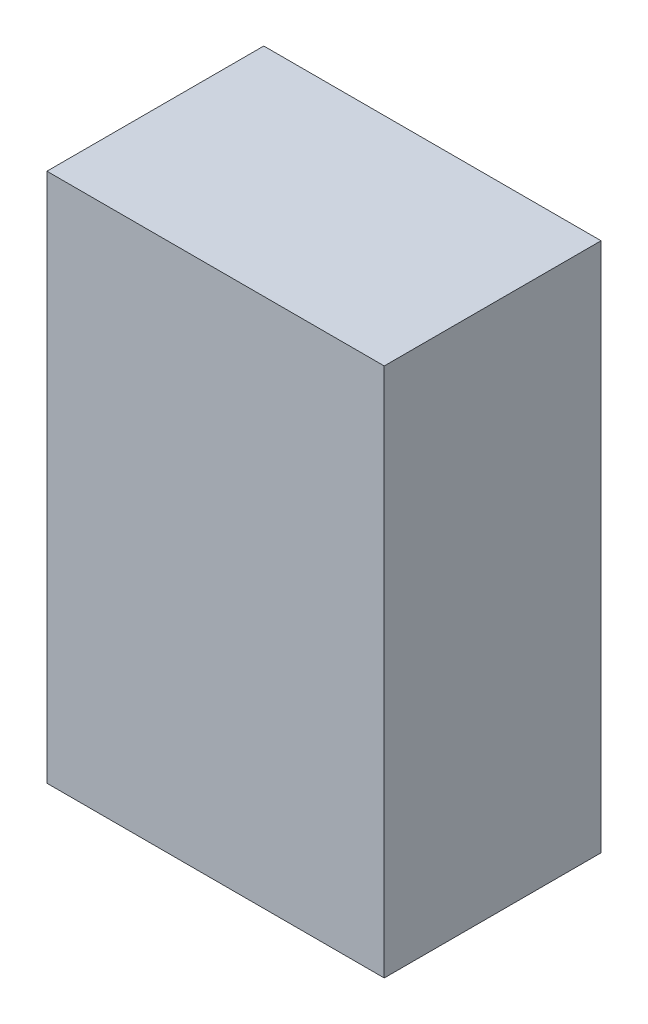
ISO-10303-21;
HEADER;
FILE_DESCRIPTION(('STEP AP214'),'2;1');
FILE_NAME('part.step','',(''),(''),'','','');
FILE_SCHEMA(('AUTOMOTIVE_DESIGN { 1 0 10303 214 1 1 1 1 }'));
ENDSEC;
DATA;
#1=APPLICATION_CONTEXT('core data for automotive mechanical design processes');
#2=APPLICATION_PROTOCOL_DEFINITION('international standard','automotive_design',2000,#1);
#3=PRODUCT_CONTEXT('',#1,'mechanical');
#4=PRODUCT('Part','Part','',(#3));
#5=PRODUCT_RELATED_PRODUCT_CATEGORY('part','',(#4));
#6=PRODUCT_DEFINITION_FORMATION('','',#4);
#7=PRODUCT_DEFINITION_CONTEXT('part definition',#1,'design');
#8=PRODUCT_DEFINITION('design','',#6,#7);
#9=PRODUCT_DEFINITION_SHAPE('','',#8);
#10=(LENGTH_UNIT() NAMED_UNIT(*) SI_UNIT(.MILLI.,.METRE.));
#11=(NAMED_UNIT(*) PLANE_ANGLE_UNIT() SI_UNIT($,.RADIAN.));
#12=(NAMED_UNIT(*) SI_UNIT($,.STERADIAN.) SOLID_ANGLE_UNIT());
#13=UNCERTAINTY_MEASURE_WITH_UNIT(LENGTH_MEASURE(1.E-05),#10,'distance_accuracy_value','');
#14=(GEOMETRIC_REPRESENTATION_CONTEXT(3) GLOBAL_UNCERTAINTY_ASSIGNED_CONTEXT((#13)) GLOBAL_UNIT_ASSIGNED_CONTEXT((#10,
#11,#12)) REPRESENTATION_CONTEXT('',''));
#15=CARTESIAN_POINT('',(0.,0.,0.));
#16=DIRECTION('',(0.,0.,1.));
#17=DIRECTION('',(1.,0.,0.));
#18=AXIS2_PLACEMENT_3D('',#15,#16,#17);
#19=CARTESIAN_POINT('',(0.,0.,0.90000074));
#20=DIRECTION('',(0.,0.,-1.));
#21=DIRECTION('',(0.,-1.,0.));
#22=AXIS2_PLACEMENT_3D('',#19,#20,#21);
#23=PLANE('',#22);
#24=DIRECTION('',(1.,0.,0.));
#25=VECTOR('',#24,1.);
#26=CARTESIAN_POINT('',(-0.70000114,1.10000034,0.90000074));
#27=LINE('',#26,#25);
#28=CARTESIAN_POINT('',(-0.70000114,1.10000034,0.90000074));
#29=VERTEX_POINT('',#28);
#30=CARTESIAN_POINT('',(0.70000114,1.10000034,0.90000074));
#31=VERTEX_POINT('',#30);
#32=EDGE_CURVE('E26',#29,#31,#27,.T.);
#33=ORIENTED_EDGE('',*,*,#32,.F.);
#34=DIRECTION('',(0.,1.,0.));
#35=VECTOR('',#34,1.);
#36=CARTESIAN_POINT('',(-0.70000114,-1.10000034,0.90000074));
#37=LINE('',#36,#35);
#38=CARTESIAN_POINT('',(-0.70000114,-1.10000034,0.90000074));
#39=VERTEX_POINT('',#38);
#40=EDGE_CURVE('E77',#39,#29,#37,.T.);
#41=ORIENTED_EDGE('',*,*,#40,.F.);
#42=DIRECTION('',(-1.,0.,0.));
#43=VECTOR('',#42,1.);
#44=CARTESIAN_POINT('',(0.70000114,-1.10000034,0.90000074));
#45=LINE('',#44,#43);
#46=CARTESIAN_POINT('',(0.70000114,-1.10000034,0.90000074));
#47=VERTEX_POINT('',#46);
#48=EDGE_CURVE('E85',#47,#39,#45,.T.);
#49=ORIENTED_EDGE('',*,*,#48,.F.);
#50=DIRECTION('',(0.,-1.,0.));
#51=VECTOR('',#50,1.);
#52=CARTESIAN_POINT('',(0.70000114,1.10000034,0.90000074));
#53=LINE('',#52,#51);
#54=EDGE_CURVE('E89',#31,#47,#53,.T.);
#55=ORIENTED_EDGE('',*,*,#54,.F.);
#56=EDGE_LOOP('',(#33,#41,#49,#55));
#57=FACE_BOUND('',#56,.T.);
#58=ADVANCED_FACE('F17',(#57),#23,.F.);
#59=CARTESIAN_POINT('',(0.,0.,0.));
#60=DIRECTION('',(0.,0.,-1.));
#61=DIRECTION('',(0.,-1.,0.));
#62=AXIS2_PLACEMENT_3D('',#59,#60,#61);
#63=PLANE('',#62);
#64=DIRECTION('',(0.,-1.,0.));
#65=VECTOR('',#64,1.);
#66=CARTESIAN_POINT('',(0.70000114,1.10000034,0.));
#67=LINE('',#66,#65);
#68=CARTESIAN_POINT('',(0.70000114,1.10000034,0.));
#69=VERTEX_POINT('',#68);
#70=CARTESIAN_POINT('',(0.70000114,-1.10000034,0.));
#71=VERTEX_POINT('',#70);
#72=EDGE_CURVE('E80',#69,#71,#67,.T.);
#73=ORIENTED_EDGE('',*,*,#72,.T.);
#74=DIRECTION('',(-1.,0.,0.));
#75=VECTOR('',#74,1.);
#76=CARTESIAN_POINT('',(0.70000114,-1.10000034,0.));
#77=LINE('',#76,#75);
#78=CARTESIAN_POINT('',(-0.70000114,-1.10000034,0.));
#79=VERTEX_POINT('',#78);
#80=EDGE_CURVE('E66',#71,#79,#77,.T.);
#81=ORIENTED_EDGE('',*,*,#80,.T.);
#82=DIRECTION('',(0.,1.,0.));
#83=VECTOR('',#82,1.);
#84=CARTESIAN_POINT('',(-0.70000114,-1.10000034,0.));
#85=LINE('',#84,#83);
#86=CARTESIAN_POINT('',(-0.70000114,1.10000034,0.));
#87=VERTEX_POINT('',#86);
#88=EDGE_CURVE('E110',#79,#87,#85,.T.);
#89=ORIENTED_EDGE('',*,*,#88,.T.);
#90=DIRECTION('',(1.,0.,0.));
#91=VECTOR('',#90,1.);
#92=CARTESIAN_POINT('',(-0.70000114,1.10000034,0.));
#93=LINE('',#92,#91);
#94=EDGE_CURVE('E11',#87,#69,#93,.T.);
#95=ORIENTED_EDGE('',*,*,#94,.T.);
#96=EDGE_LOOP('',(#73,#81,#89,#95));
#97=FACE_BOUND('',#96,.T.);
#98=ADVANCED_FACE('F81',(#97),#63,.T.);
#99=CARTESIAN_POINT('',(-0.70000114,1.10000034,0.));
#100=DIRECTION('',(0.,1.,0.));
#101=DIRECTION('',(1.,0.,0.));
#102=AXIS2_PLACEMENT_3D('',#99,#100,#101);
#103=PLANE('',#102);
#104=DIRECTION('',(0.,0.,1.));
#105=VECTOR('',#104,1.);
#106=CARTESIAN_POINT('',(-0.70000114,1.10000034,0.));
#107=LINE('',#106,#105);
#108=EDGE_CURVE('E107',#87,#29,#107,.T.);
#109=ORIENTED_EDGE('',*,*,#108,.T.);
#110=ORIENTED_EDGE('',*,*,#32,.T.);
#111=DIRECTION('',(0.,0.,1.));
#112=VECTOR('',#111,1.);
#113=CARTESIAN_POINT('',(0.70000114,1.10000034,0.));
#114=LINE('',#113,#112);
#115=EDGE_CURVE('E96',#69,#31,#114,.T.);
#116=ORIENTED_EDGE('',*,*,#115,.F.);
#117=ORIENTED_EDGE('',*,*,#94,.F.);
#118=EDGE_LOOP('',(#109,#110,#116,#117));
#119=FACE_BOUND('',#118,.T.);
#120=ADVANCED_FACE('F115',(#119),#103,.T.);
#121=CARTESIAN_POINT('',(-0.70000114,-1.10000034,0.));
#122=DIRECTION('',(-1.,0.,0.));
#123=DIRECTION('',(0.,0.,1.));
#124=AXIS2_PLACEMENT_3D('',#121,#122,#123);
#125=PLANE('',#124);
#126=DIRECTION('',(0.,0.,1.));
#127=VECTOR('',#126,1.);
#128=CARTESIAN_POINT('',(-0.70000114,-1.10000034,0.));
#129=LINE('',#128,#127);
#130=EDGE_CURVE('E74',#79,#39,#129,.T.);
#131=ORIENTED_EDGE('',*,*,#130,.T.);
#132=ORIENTED_EDGE('',*,*,#40,.T.);
#133=ORIENTED_EDGE('',*,*,#108,.F.);
#134=ORIENTED_EDGE('',*,*,#88,.F.);
#135=EDGE_LOOP('',(#131,#132,#133,#134));
#136=FACE_BOUND('',#135,.T.);
#137=ADVANCED_FACE('F166',(#136),#125,.T.);
#138=CARTESIAN_POINT('',(0.70000114,-1.10000034,0.));
#139=DIRECTION('',(0.,-1.,0.));
#140=DIRECTION('',(0.,0.,-1.));
#141=AXIS2_PLACEMENT_3D('',#138,#139,#140);
#142=PLANE('',#141);
#143=DIRECTION('',(0.,0.,1.));
#144=VECTOR('',#143,1.);
#145=CARTESIAN_POINT('',(0.70000114,-1.10000034,0.));
#146=LINE('',#145,#144);
#147=EDGE_CURVE('E71',#71,#47,#146,.T.);
#148=ORIENTED_EDGE('',*,*,#147,.T.);
#149=ORIENTED_EDGE('',*,*,#48,.T.);
#150=ORIENTED_EDGE('',*,*,#130,.F.);
#151=ORIENTED_EDGE('',*,*,#80,.F.);
#152=EDGE_LOOP('',(#148,#149,#150,#151));
#153=FACE_BOUND('',#152,.T.);
#154=ADVANCED_FACE('F68',(#153),#142,.T.);
#155=CARTESIAN_POINT('',(0.70000114,1.10000034,0.));
#156=DIRECTION('',(1.,0.,0.));
#157=DIRECTION('',(0.,1.,0.));
#158=AXIS2_PLACEMENT_3D('',#155,#156,#157);
#159=PLANE('',#158);
#160=ORIENTED_EDGE('',*,*,#115,.T.);
#161=ORIENTED_EDGE('',*,*,#54,.T.);
#162=ORIENTED_EDGE('',*,*,#147,.F.);
#163=ORIENTED_EDGE('',*,*,#72,.F.);
#164=EDGE_LOOP('',(#160,#161,#162,#163));
#165=FACE_BOUND('',#164,.T.);
#166=ADVANCED_FACE('F87',(#165),#159,.T.);
#167=CLOSED_SHELL('',(#58,#98,#120,#137,#154,#166));
#168=MANIFOLD_SOLID_BREP('B1',#167);
#169=ADVANCED_BREP_SHAPE_REPRESENTATION('',(#18,#168),#14);
#170=SHAPE_DEFINITION_REPRESENTATION(#9,#169);
ENDSEC;
END-ISO-10303-21;
